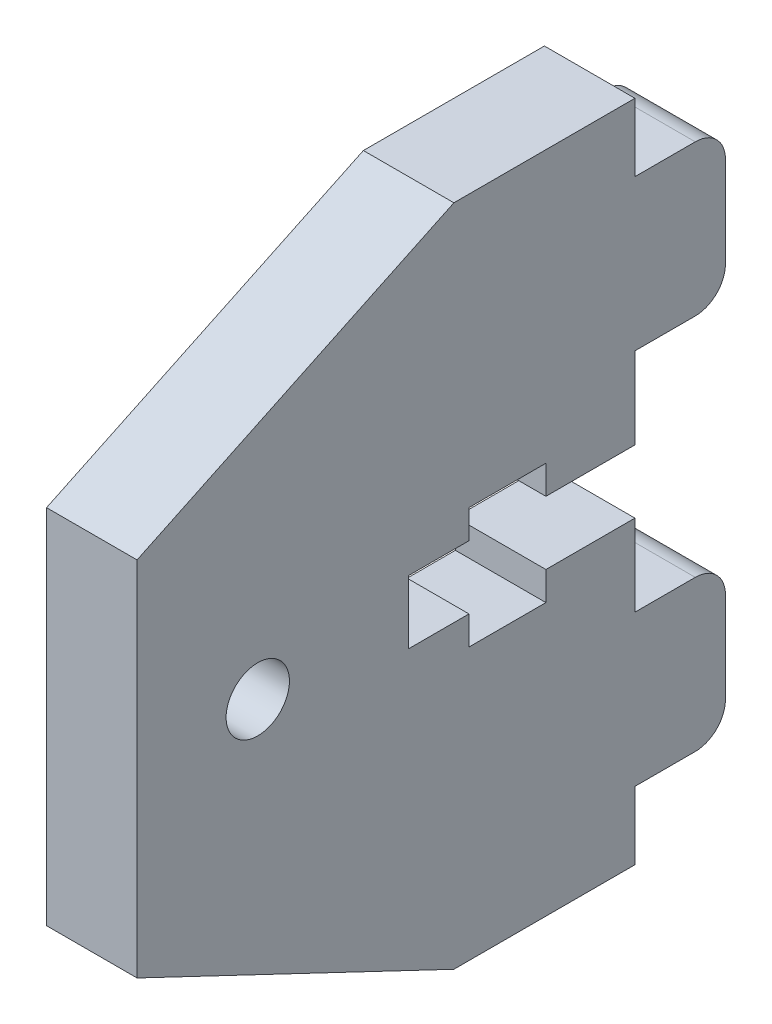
ISO-10303-21;
HEADER;
FILE_DESCRIPTION(('STEP AP214'),'2;1');
FILE_NAME('part.step','',(''),(''),'','','');
FILE_SCHEMA(('AUTOMOTIVE_DESIGN { 1 0 10303 214 1 1 1 1 }'));
ENDSEC;
DATA;
#1=APPLICATION_CONTEXT('core data for automotive mechanical design processes');
#2=APPLICATION_PROTOCOL_DEFINITION('international standard','automotive_design',2000,#1);
#3=PRODUCT_CONTEXT('',#1,'mechanical');
#4=PRODUCT('Part','Part','',(#3));
#5=PRODUCT_RELATED_PRODUCT_CATEGORY('part','',(#4));
#6=PRODUCT_DEFINITION_FORMATION('','',#4);
#7=PRODUCT_DEFINITION_CONTEXT('part definition',#1,'design');
#8=PRODUCT_DEFINITION('design','',#6,#7);
#9=PRODUCT_DEFINITION_SHAPE('','',#8);
#10=(LENGTH_UNIT() NAMED_UNIT(*) SI_UNIT(.MILLI.,.METRE.));
#11=(NAMED_UNIT(*) PLANE_ANGLE_UNIT() SI_UNIT($,.RADIAN.));
#12=(NAMED_UNIT(*) SI_UNIT($,.STERADIAN.) SOLID_ANGLE_UNIT());
#13=UNCERTAINTY_MEASURE_WITH_UNIT(LENGTH_MEASURE(1.E-05),#10,'distance_accuracy_value','');
#14=(GEOMETRIC_REPRESENTATION_CONTEXT(3) GLOBAL_UNCERTAINTY_ASSIGNED_CONTEXT((#13)) GLOBAL_UNIT_ASSIGNED_CONTEXT((#10,
#11,#12)) REPRESENTATION_CONTEXT('',''));
#15=CARTESIAN_POINT('',(0.,0.,0.));
#16=DIRECTION('',(0.,0.,1.));
#17=DIRECTION('',(1.,0.,0.));
#18=AXIS2_PLACEMENT_3D('',#15,#16,#17);
#19=CARTESIAN_POINT('',(6.,29.5,0.));
#20=DIRECTION('',(0.,1.,0.));
#21=DIRECTION('',(0.,0.,1.));
#22=AXIS2_PLACEMENT_3D('',#19,#20,#21);
#23=PLANE('',#22);
#24=DIRECTION('',(0.,0.,-1.));
#25=VECTOR('',#24,1.);
#26=CARTESIAN_POINT('',(0.,29.5,0.));
#27=LINE('',#26,#25);
#28=CARTESIAN_POINT('',(0.,29.5,0.));
#29=VERTEX_POINT('',#28);
#30=CARTESIAN_POINT('',(0.,29.5,-4.));
#31=VERTEX_POINT('',#30);
#32=EDGE_CURVE('E411',#29,#31,#27,.T.);
#33=ORIENTED_EDGE('',*,*,#32,.T.);
#34=DIRECTION('',(-1.,0.,0.));
#35=VECTOR('',#34,1.);
#36=CARTESIAN_POINT('',(6.,29.5,-4.));
#37=LINE('',#36,#35);
#38=CARTESIAN_POINT('',(6.,29.5,-4.));
#39=VERTEX_POINT('',#38);
#40=EDGE_CURVE('E11',#39,#31,#37,.T.);
#41=ORIENTED_EDGE('',*,*,#40,.F.);
#42=DIRECTION('',(0.,0.,-1.));
#43=VECTOR('',#42,1.);
#44=CARTESIAN_POINT('',(6.,29.5,0.));
#45=LINE('',#44,#43);
#46=CARTESIAN_POINT('',(6.,29.5,0.));
#47=VERTEX_POINT('',#46);
#48=EDGE_CURVE('E326',#47,#39,#45,.T.);
#49=ORIENTED_EDGE('',*,*,#48,.F.);
#50=DIRECTION('',(-1.,0.,0.));
#51=VECTOR('',#50,1.);
#52=CARTESIAN_POINT('',(6.,29.5,0.));
#53=LINE('',#52,#51);
#54=EDGE_CURVE('E342',#47,#29,#53,.T.);
#55=ORIENTED_EDGE('',*,*,#54,.T.);
#56=EDGE_LOOP('',(#33,#41,#49,#55));
#57=FACE_BOUND('',#56,.T.);
#58=ADVANCED_FACE('F37',(#57),#23,.F.);
#59=CARTESIAN_POINT('',(6.,31.5,-4.));
#60=DIRECTION('',(-1.,0.,0.));
#61=DIRECTION('',(0.,0.,1.));
#62=AXIS2_PLACEMENT_3D('',#59,#60,#61);
#63=CYLINDRICAL_SURFACE('',#62,2.);
#64=CARTESIAN_POINT('',(0.,31.5,-4.));
#65=DIRECTION('',(1.,0.,0.));
#66=DIRECTION('',(0.,0.,-1.));
#67=AXIS2_PLACEMENT_3D('',#64,#65,#66);
#68=CIRCLE('',#67,2.);
#69=CARTESIAN_POINT('',(0.,31.5,-6.));
#70=VERTEX_POINT('',#69);
#71=EDGE_CURVE('E406',#31,#70,#68,.T.);
#72=ORIENTED_EDGE('',*,*,#71,.T.);
#73=DIRECTION('',(-1.,0.,0.));
#74=VECTOR('',#73,1.);
#75=CARTESIAN_POINT('',(6.,31.5,-6.));
#76=LINE('',#75,#74);
#77=CARTESIAN_POINT('',(6.,31.5,-6.));
#78=VERTEX_POINT('',#77);
#79=EDGE_CURVE('E45',#78,#70,#76,.T.);
#80=ORIENTED_EDGE('',*,*,#79,.F.);
#81=CARTESIAN_POINT('',(6.,31.5,-4.));
#82=DIRECTION('',(1.,0.,0.));
#83=DIRECTION('',(0.,0.,-1.));
#84=AXIS2_PLACEMENT_3D('',#81,#82,#83);
#85=CIRCLE('',#84,2.);
#86=EDGE_CURVE('E158',#39,#78,#85,.T.);
#87=ORIENTED_EDGE('',*,*,#86,.F.);
#88=ORIENTED_EDGE('',*,*,#40,.T.);
#89=EDGE_LOOP('',(#72,#80,#87,#88));
#90=FACE_BOUND('',#89,.T.);
#91=ADVANCED_FACE('F407',(#90),#63,.T.);
#92=CARTESIAN_POINT('',(6.,0.,-6.00000000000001));
#93=DIRECTION('',(0.,0.,-1.));
#94=DIRECTION('',(0.,1.,0.));
#95=AXIS2_PLACEMENT_3D('',#92,#93,#94);
#96=PLANE('',#95);
#97=DIRECTION('',(0.,-1.,0.));
#98=VECTOR('',#97,1.);
#99=CARTESIAN_POINT('',(0.,0.,-6.00000000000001));
#100=LINE('',#99,#98);
#101=CARTESIAN_POINT('',(0.,37.5,-6.));
#102=VERTEX_POINT('',#101);
#103=EDGE_CURVE('E403',#102,#70,#100,.T.);
#104=ORIENTED_EDGE('',*,*,#103,.F.);
#105=DIRECTION('',(-1.,0.,0.));
#106=VECTOR('',#105,1.);
#107=CARTESIAN_POINT('',(6.,37.5,-6.));
#108=LINE('',#107,#106);
#109=CARTESIAN_POINT('',(6.,37.5,-6.));
#110=VERTEX_POINT('',#109);
#111=EDGE_CURVE('E397',#110,#102,#108,.T.);
#112=ORIENTED_EDGE('',*,*,#111,.F.);
#113=DIRECTION('',(0.,-1.,0.));
#114=VECTOR('',#113,1.);
#115=CARTESIAN_POINT('',(6.,0.,-6.00000000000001));
#116=LINE('',#115,#114);
#117=EDGE_CURVE('E322',#110,#78,#116,.T.);
#118=ORIENTED_EDGE('',*,*,#117,.T.);
#119=ORIENTED_EDGE('',*,*,#79,.T.);
#120=EDGE_LOOP('',(#104,#112,#118,#119));
#121=FACE_BOUND('',#120,.T.);
#122=ADVANCED_FACE('F401',(#121),#96,.T.);
#123=CARTESIAN_POINT('',(6.,37.5,-4.));
#124=DIRECTION('',(-1.,0.,0.));
#125=DIRECTION('',(0.,0.,1.));
#126=AXIS2_PLACEMENT_3D('',#123,#124,#125);
#127=CYLINDRICAL_SURFACE('',#126,2.);
#128=CARTESIAN_POINT('',(0.,37.5,-4.));
#129=DIRECTION('',(1.,0.,0.));
#130=DIRECTION('',(0.,0.,-1.));
#131=AXIS2_PLACEMENT_3D('',#128,#129,#130);
#132=CIRCLE('',#131,2.);
#133=CARTESIAN_POINT('',(0.,39.5,-4.));
#134=VERTEX_POINT('',#133);
#135=EDGE_CURVE('E416',#134,#102,#132,.F.);
#136=ORIENTED_EDGE('',*,*,#135,.F.);
#137=DIRECTION('',(-1.,0.,0.));
#138=VECTOR('',#137,1.);
#139=CARTESIAN_POINT('',(6.,39.5,-4.));
#140=LINE('',#139,#138);
#141=CARTESIAN_POINT('',(6.,39.5,-4.));
#142=VERTEX_POINT('',#141);
#143=EDGE_CURVE('E395',#142,#134,#140,.T.);
#144=ORIENTED_EDGE('',*,*,#143,.F.);
#145=CARTESIAN_POINT('',(6.,37.5,-4.));
#146=DIRECTION('',(1.,0.,0.));
#147=DIRECTION('',(0.,0.,-1.));
#148=AXIS2_PLACEMENT_3D('',#145,#146,#147);
#149=CIRCLE('',#148,2.);
#150=EDGE_CURVE('E319',#142,#110,#149,.F.);
#151=ORIENTED_EDGE('',*,*,#150,.T.);
#152=ORIENTED_EDGE('',*,*,#111,.T.);
#153=EDGE_LOOP('',(#136,#144,#151,#152));
#154=FACE_BOUND('',#153,.T.);
#155=ADVANCED_FACE('F613',(#154),#127,.T.);
#156=CARTESIAN_POINT('',(6.,39.5,0.));
#157=DIRECTION('',(0.,1.,0.));
#158=DIRECTION('',(0.,0.,1.));
#159=AXIS2_PLACEMENT_3D('',#156,#157,#158);
#160=PLANE('',#159);
#161=DIRECTION('',(0.,0.,-1.));
#162=VECTOR('',#161,1.);
#163=CARTESIAN_POINT('',(0.,39.5,0.));
#164=LINE('',#163,#162);
#165=CARTESIAN_POINT('',(0.,39.5,0.));
#166=VERTEX_POINT('',#165);
#167=EDGE_CURVE('E418',#166,#134,#164,.T.);
#168=ORIENTED_EDGE('',*,*,#167,.F.);
#169=DIRECTION('',(-1.,0.,0.));
#170=VECTOR('',#169,1.);
#171=CARTESIAN_POINT('',(6.,39.5,0.));
#172=LINE('',#171,#170);
#173=CARTESIAN_POINT('',(6.,39.5,0.));
#174=VERTEX_POINT('',#173);
#175=EDGE_CURVE('E393',#174,#166,#172,.T.);
#176=ORIENTED_EDGE('',*,*,#175,.F.);
#177=DIRECTION('',(0.,0.,-1.));
#178=VECTOR('',#177,1.);
#179=CARTESIAN_POINT('',(6.,39.5,0.));
#180=LINE('',#179,#178);
#181=EDGE_CURVE('E316',#174,#142,#180,.T.);
#182=ORIENTED_EDGE('',*,*,#181,.T.);
#183=ORIENTED_EDGE('',*,*,#143,.T.);
#184=EDGE_LOOP('',(#168,#176,#182,#183));
#185=FACE_BOUND('',#184,.T.);
#186=ADVANCED_FACE('F604',(#185),#160,.T.);
#187=CARTESIAN_POINT('',(6.,0.,0.));
#188=DIRECTION('',(0.,0.,1.));
#189=DIRECTION('',(0.,-1.,0.));
#190=AXIS2_PLACEMENT_3D('',#187,#188,#189);
#191=PLANE('',#190);
#192=DIRECTION('',(0.,1.,0.));
#193=VECTOR('',#192,1.);
#194=CARTESIAN_POINT('',(0.,0.,0.));
#195=LINE('',#194,#193);
#196=CARTESIAN_POINT('',(0.,44.,0.));
#197=VERTEX_POINT('',#196);
#198=EDGE_CURVE('E337',#166,#197,#195,.T.);
#199=ORIENTED_EDGE('',*,*,#198,.T.);
#200=DIRECTION('',(-1.,0.,0.));
#201=VECTOR('',#200,1.);
#202=CARTESIAN_POINT('',(6.,44.,0.));
#203=LINE('',#202,#201);
#204=CARTESIAN_POINT('',(6.,44.,0.));
#205=VERTEX_POINT('',#204);
#206=EDGE_CURVE('E390',#205,#197,#203,.T.);
#207=ORIENTED_EDGE('',*,*,#206,.F.);
#208=DIRECTION('',(0.,1.,0.));
#209=VECTOR('',#208,1.);
#210=CARTESIAN_POINT('',(6.,0.,0.));
#211=LINE('',#210,#209);
#212=EDGE_CURVE('E267',#174,#205,#211,.T.);
#213=ORIENTED_EDGE('',*,*,#212,.F.);
#214=ORIENTED_EDGE('',*,*,#175,.T.);
#215=EDGE_LOOP('',(#199,#207,#213,#214));
#216=FACE_BOUND('',#215,.T.);
#217=ADVANCED_FACE('F569',(#216),#191,.F.);
#218=CARTESIAN_POINT('',(6.,44.,0.));
#219=DIRECTION('',(0.,-1.,0.));
#220=DIRECTION('',(0.,0.,-1.));
#221=AXIS2_PLACEMENT_3D('',#218,#219,#220);
#222=PLANE('',#221);
#223=DIRECTION('',(0.,0.,1.));
#224=VECTOR('',#223,1.);
#225=CARTESIAN_POINT('',(0.,44.,0.));
#226=LINE('',#225,#224);
#227=CARTESIAN_POINT('',(0.,44.,12.));
#228=VERTEX_POINT('',#227);
#229=EDGE_CURVE('E423',#197,#228,#226,.T.);
#230=ORIENTED_EDGE('',*,*,#229,.T.);
#231=DIRECTION('',(-1.,0.,0.));
#232=VECTOR('',#231,1.);
#233=CARTESIAN_POINT('',(6.,44.,12.));
#234=LINE('',#233,#232);
#235=CARTESIAN_POINT('',(6.,44.,12.));
#236=VERTEX_POINT('',#235);
#237=EDGE_CURVE('E388',#236,#228,#234,.T.);
#238=ORIENTED_EDGE('',*,*,#237,.F.);
#239=DIRECTION('',(0.,0.,1.));
#240=VECTOR('',#239,1.);
#241=CARTESIAN_POINT('',(6.,44.,0.));
#242=LINE('',#241,#240);
#243=EDGE_CURVE('E314',#205,#236,#242,.T.);
#244=ORIENTED_EDGE('',*,*,#243,.F.);
#245=ORIENTED_EDGE('',*,*,#206,.T.);
#246=EDGE_LOOP('',(#230,#238,#244,#245));
#247=FACE_BOUND('',#246,.T.);
#248=ADVANCED_FACE('F603',(#247),#222,.F.);
#249=CARTESIAN_POINT('',(6.,40.5249537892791,19.2975970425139));
#250=DIRECTION('',(0.,0.90286051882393,0.429933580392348));
#251=DIRECTION('',(0.,-0.429933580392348,0.90286051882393));
#252=AXIS2_PLACEMENT_3D('',#249,#250,#251);
#253=PLANE('',#252);
#254=DIRECTION('',(0.,0.429933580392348,-0.90286051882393));
#255=VECTOR('',#254,1.);
#256=CARTESIAN_POINT('',(0.,40.5249537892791,19.2975970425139));
#257=LINE('',#256,#255);
#258=CARTESIAN_POINT('',(0.,34.,33.));
#259=VERTEX_POINT('',#258);
#260=EDGE_CURVE('E427',#259,#228,#257,.T.);
#261=ORIENTED_EDGE('',*,*,#260,.F.);
#262=DIRECTION('',(-1.,0.,0.));
#263=VECTOR('',#262,1.);
#264=CARTESIAN_POINT('',(6.,34.,33.));
#265=LINE('',#264,#263);
#266=CARTESIAN_POINT('',(6.,34.,33.));
#267=VERTEX_POINT('',#266);
#268=EDGE_CURVE('E386',#267,#259,#265,.T.);
#269=ORIENTED_EDGE('',*,*,#268,.F.);
#270=DIRECTION('',(0.,0.429933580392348,-0.90286051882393));
#271=VECTOR('',#270,1.);
#272=CARTESIAN_POINT('',(6.,40.5249537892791,19.2975970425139));
#273=LINE('',#272,#271);
#274=EDGE_CURVE('E311',#267,#236,#273,.T.);
#275=ORIENTED_EDGE('',*,*,#274,.T.);
#276=ORIENTED_EDGE('',*,*,#237,.T.);
#277=EDGE_LOOP('',(#261,#269,#275,#276));
#278=FACE_BOUND('',#277,.T.);
#279=ADVANCED_FACE('F610',(#278),#253,.T.);
#280=CARTESIAN_POINT('',(6.,0.,33.));
#281=DIRECTION('',(0.,0.,1.));
#282=DIRECTION('',(0.,-1.,0.));
#283=AXIS2_PLACEMENT_3D('',#280,#281,#282);
#284=PLANE('',#283);
#285=DIRECTION('',(0.,1.,0.));
#286=VECTOR('',#285,1.);
#287=CARTESIAN_POINT('',(0.,0.,33.));
#288=LINE('',#287,#286);
#289=CARTESIAN_POINT('',(0.,9.99999999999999,33.));
#290=VERTEX_POINT('',#289);
#291=EDGE_CURVE('E430',#290,#259,#288,.T.);
#292=ORIENTED_EDGE('',*,*,#291,.F.);
#293=DIRECTION('',(-1.,0.,0.));
#294=VECTOR('',#293,1.);
#295=CARTESIAN_POINT('',(6.,9.99999999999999,33.));
#296=LINE('',#295,#294);
#297=CARTESIAN_POINT('',(6.,9.99999999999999,33.));
#298=VERTEX_POINT('',#297);
#299=EDGE_CURVE('E384',#298,#290,#296,.T.);
#300=ORIENTED_EDGE('',*,*,#299,.F.);
#301=DIRECTION('',(0.,1.,0.));
#302=VECTOR('',#301,1.);
#303=CARTESIAN_POINT('',(6.,0.,33.));
#304=LINE('',#303,#302);
#305=EDGE_CURVE('E308',#298,#267,#304,.T.);
#306=ORIENTED_EDGE('',*,*,#305,.T.);
#307=ORIENTED_EDGE('',*,*,#268,.T.);
#308=EDGE_LOOP('',(#292,#300,#306,#307));
#309=FACE_BOUND('',#308,.T.);
#310=ADVANCED_FACE('F630',(#309),#284,.T.);
#311=CARTESIAN_POINT('',(6.,-4.65804066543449,2.21811460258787));
#312=DIRECTION('',(0.,0.902860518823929,-0.429933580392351));
#313=DIRECTION('',(0.,0.429933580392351,0.902860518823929));
#314=AXIS2_PLACEMENT_3D('',#311,#312,#313);
#315=PLANE('',#314);
#316=DIRECTION('',(0.,-0.429933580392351,-0.902860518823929));
#317=VECTOR('',#316,1.);
#318=CARTESIAN_POINT('',(0.,-4.65804066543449,2.21811460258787));
#319=LINE('',#318,#317);
#320=CARTESIAN_POINT('',(0.,0.,12.0000000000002));
#321=VERTEX_POINT('',#320);
#322=EDGE_CURVE('E433',#290,#321,#319,.T.);
#323=ORIENTED_EDGE('',*,*,#322,.T.);
#324=DIRECTION('',(-1.,0.,0.));
#325=VECTOR('',#324,1.);
#326=CARTESIAN_POINT('',(6.,0.,12.0000000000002));
#327=LINE('',#326,#325);
#328=CARTESIAN_POINT('',(6.,0.,12.0000000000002));
#329=VERTEX_POINT('',#328);
#330=EDGE_CURVE('E382',#329,#321,#327,.T.);
#331=ORIENTED_EDGE('',*,*,#330,.F.);
#332=DIRECTION('',(0.,-0.429933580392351,-0.902860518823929));
#333=VECTOR('',#332,1.);
#334=CARTESIAN_POINT('',(6.,-4.65804066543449,2.21811460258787));
#335=LINE('',#334,#333);
#336=EDGE_CURVE('E306',#298,#329,#335,.T.);
#337=ORIENTED_EDGE('',*,*,#336,.F.);
#338=ORIENTED_EDGE('',*,*,#299,.T.);
#339=EDGE_LOOP('',(#323,#331,#337,#338));
#340=FACE_BOUND('',#339,.T.);
#341=ADVANCED_FACE('F599',(#340),#315,.F.);
#342=CARTESIAN_POINT('',(6.,0.,0.));
#343=DIRECTION('',(0.,-1.,0.));
#344=DIRECTION('',(0.,0.,-1.));
#345=AXIS2_PLACEMENT_3D('',#342,#343,#344);
#346=PLANE('',#345);
#347=DIRECTION('',(0.,0.,1.));
#348=VECTOR('',#347,1.);
#349=CARTESIAN_POINT('',(0.,0.,0.));
#350=LINE('',#349,#348);
#351=CARTESIAN_POINT('',(0.,0.,0.));
#352=VERTEX_POINT('',#351);
#353=EDGE_CURVE('E436',#352,#321,#350,.T.);
#354=ORIENTED_EDGE('',*,*,#353,.F.);
#355=DIRECTION('',(-1.,0.,0.));
#356=VECTOR('',#355,1.);
#357=CARTESIAN_POINT('',(6.,0.,0.));
#358=LINE('',#357,#356);
#359=CARTESIAN_POINT('',(6.,0.,0.));
#360=VERTEX_POINT('',#359);
#361=EDGE_CURVE('E380',#360,#352,#358,.T.);
#362=ORIENTED_EDGE('',*,*,#361,.F.);
#363=DIRECTION('',(0.,0.,1.));
#364=VECTOR('',#363,1.);
#365=CARTESIAN_POINT('',(6.,0.,0.));
#366=LINE('',#365,#364);
#367=EDGE_CURVE('E303',#360,#329,#366,.T.);
#368=ORIENTED_EDGE('',*,*,#367,.T.);
#369=ORIENTED_EDGE('',*,*,#330,.T.);
#370=EDGE_LOOP('',(#354,#362,#368,#369));
#371=FACE_BOUND('',#370,.T.);
#372=ADVANCED_FACE('F593',(#371),#346,.T.);
#373=CARTESIAN_POINT('',(0.,4.5,0.));
#374=VERTEX_POINT('',#373);
#375=EDGE_CURVE('E424',#352,#374,#195,.T.);
#376=ORIENTED_EDGE('',*,*,#375,.T.);
#377=DIRECTION('',(-1.,0.,0.));
#378=VECTOR('',#377,1.);
#379=CARTESIAN_POINT('',(6.,4.5,0.));
#380=LINE('',#379,#378);
#381=CARTESIAN_POINT('',(6.,4.5,0.));
#382=VERTEX_POINT('',#381);
#383=EDGE_CURVE('E377',#382,#374,#380,.T.);
#384=ORIENTED_EDGE('',*,*,#383,.F.);
#385=EDGE_CURVE('E302',#360,#382,#211,.T.);
#386=ORIENTED_EDGE('',*,*,#385,.F.);
#387=ORIENTED_EDGE('',*,*,#361,.T.);
#388=EDGE_LOOP('',(#376,#384,#386,#387));
#389=FACE_BOUND('',#388,.T.);
#390=ADVANCED_FACE('F514',(#389),#191,.F.);
#391=CARTESIAN_POINT('',(6.,4.5,0.));
#392=DIRECTION('',(0.,1.,0.));
#393=DIRECTION('',(0.,0.,1.));
#394=AXIS2_PLACEMENT_3D('',#391,#392,#393);
#395=PLANE('',#394);
#396=DIRECTION('',(0.,0.,-1.));
#397=VECTOR('',#396,1.);
#398=CARTESIAN_POINT('',(0.,4.5,0.));
#399=LINE('',#398,#397);
#400=CARTESIAN_POINT('',(0.,4.5,-4.));
#401=VERTEX_POINT('',#400);
#402=EDGE_CURVE('E439',#374,#401,#399,.T.);
#403=ORIENTED_EDGE('',*,*,#402,.T.);
#404=DIRECTION('',(-1.,0.,0.));
#405=VECTOR('',#404,1.);
#406=CARTESIAN_POINT('',(6.,4.5,-4.));
#407=LINE('',#406,#405);
#408=CARTESIAN_POINT('',(6.,4.5,-4.));
#409=VERTEX_POINT('',#408);
#410=EDGE_CURVE('E374',#409,#401,#407,.T.);
#411=ORIENTED_EDGE('',*,*,#410,.F.);
#412=DIRECTION('',(0.,0.,-1.));
#413=VECTOR('',#412,1.);
#414=CARTESIAN_POINT('',(6.,4.5,0.));
#415=LINE('',#414,#413);
#416=EDGE_CURVE('E300',#382,#409,#415,.T.);
#417=ORIENTED_EDGE('',*,*,#416,.F.);
#418=ORIENTED_EDGE('',*,*,#383,.T.);
#419=EDGE_LOOP('',(#403,#411,#417,#418));
#420=FACE_BOUND('',#419,.T.);
#421=ADVANCED_FACE('F520',(#420),#395,.F.);
#422=CARTESIAN_POINT('',(6.,6.5,-4.));
#423=DIRECTION('',(-1.,0.,0.));
#424=DIRECTION('',(0.,0.,1.));
#425=AXIS2_PLACEMENT_3D('',#422,#423,#424);
#426=CYLINDRICAL_SURFACE('',#425,2.);
#427=CARTESIAN_POINT('',(0.,6.5,-4.));
#428=DIRECTION('',(1.,0.,0.));
#429=DIRECTION('',(0.,0.,-1.));
#430=AXIS2_PLACEMENT_3D('',#427,#428,#429);
#431=CIRCLE('',#430,2.);
#432=CARTESIAN_POINT('',(0.,6.5,-6.));
#433=VERTEX_POINT('',#432);
#434=EDGE_CURVE('E441',#401,#433,#431,.T.);
#435=ORIENTED_EDGE('',*,*,#434,.T.);
#436=DIRECTION('',(-1.,0.,0.));
#437=VECTOR('',#436,1.);
#438=CARTESIAN_POINT('',(6.,6.5,-6.));
#439=LINE('',#438,#437);
#440=CARTESIAN_POINT('',(6.,6.5,-6.));
#441=VERTEX_POINT('',#440);
#442=EDGE_CURVE('E372',#441,#433,#439,.T.);
#443=ORIENTED_EDGE('',*,*,#442,.F.);
#444=CARTESIAN_POINT('',(6.,6.5,-4.));
#445=DIRECTION('',(1.,0.,0.));
#446=DIRECTION('',(0.,0.,-1.));
#447=AXIS2_PLACEMENT_3D('',#444,#445,#446);
#448=CIRCLE('',#447,2.);
#449=EDGE_CURVE('E298',#409,#441,#448,.T.);
#450=ORIENTED_EDGE('',*,*,#449,.F.);
#451=ORIENTED_EDGE('',*,*,#410,.T.);
#452=EDGE_LOOP('',(#435,#443,#450,#451));
#453=FACE_BOUND('',#452,.T.);
#454=ADVANCED_FACE('F526',(#453),#426,.T.);
#455=CARTESIAN_POINT('',(6.,0.,-6.));
#456=DIRECTION('',(0.,0.,-1.));
#457=DIRECTION('',(0.,1.,0.));
#458=AXIS2_PLACEMENT_3D('',#455,#456,#457);
#459=PLANE('',#458);
#460=DIRECTION('',(0.,-1.,0.));
#461=VECTOR('',#460,1.);
#462=CARTESIAN_POINT('',(0.,0.,-6.));
#463=LINE('',#462,#461);
#464=CARTESIAN_POINT('',(0.,12.5,-6.));
#465=VERTEX_POINT('',#464);
#466=EDGE_CURVE('E444',#465,#433,#463,.T.);
#467=ORIENTED_EDGE('',*,*,#466,.F.);
#468=DIRECTION('',(-1.,0.,0.));
#469=VECTOR('',#468,1.);
#470=CARTESIAN_POINT('',(6.,12.5,-6.));
#471=LINE('',#470,#469);
#472=CARTESIAN_POINT('',(6.,12.5,-6.));
#473=VERTEX_POINT('',#472);
#474=EDGE_CURVE('E370',#473,#465,#471,.T.);
#475=ORIENTED_EDGE('',*,*,#474,.F.);
#476=DIRECTION('',(0.,-1.,0.));
#477=VECTOR('',#476,1.);
#478=CARTESIAN_POINT('',(6.,0.,-6.));
#479=LINE('',#478,#477);
#480=EDGE_CURVE('E295',#473,#441,#479,.T.);
#481=ORIENTED_EDGE('',*,*,#480,.T.);
#482=ORIENTED_EDGE('',*,*,#442,.T.);
#483=EDGE_LOOP('',(#467,#475,#481,#482));
#484=FACE_BOUND('',#483,.T.);
#485=ADVANCED_FACE('F537',(#484),#459,.T.);
#486=CARTESIAN_POINT('',(6.,12.5,-4.));
#487=DIRECTION('',(-1.,0.,0.));
#488=DIRECTION('',(0.,0.,1.));
#489=AXIS2_PLACEMENT_3D('',#486,#487,#488);
#490=CYLINDRICAL_SURFACE('',#489,2.);
#491=CARTESIAN_POINT('',(0.,12.5,-4.));
#492=DIRECTION('',(1.,0.,0.));
#493=DIRECTION('',(0.,0.,-1.));
#494=AXIS2_PLACEMENT_3D('',#491,#492,#493);
#495=CIRCLE('',#494,2.);
#496=CARTESIAN_POINT('',(0.,14.5,-4.));
#497=VERTEX_POINT('',#496);
#498=EDGE_CURVE('E447',#497,#465,#495,.F.);
#499=ORIENTED_EDGE('',*,*,#498,.F.);
#500=DIRECTION('',(-1.,0.,0.));
#501=VECTOR('',#500,1.);
#502=CARTESIAN_POINT('',(6.,14.5,-4.));
#503=LINE('',#502,#501);
#504=CARTESIAN_POINT('',(6.,14.5,-4.));
#505=VERTEX_POINT('',#504);
#506=EDGE_CURVE('E368',#505,#497,#503,.T.);
#507=ORIENTED_EDGE('',*,*,#506,.F.);
#508=CARTESIAN_POINT('',(6.,12.5,-4.));
#509=DIRECTION('',(1.,0.,0.));
#510=DIRECTION('',(0.,0.,-1.));
#511=AXIS2_PLACEMENT_3D('',#508,#509,#510);
#512=CIRCLE('',#511,2.);
#513=EDGE_CURVE('E292',#505,#473,#512,.F.);
#514=ORIENTED_EDGE('',*,*,#513,.T.);
#515=ORIENTED_EDGE('',*,*,#474,.T.);
#516=EDGE_LOOP('',(#499,#507,#514,#515));
#517=FACE_BOUND('',#516,.T.);
#518=ADVANCED_FACE('F535',(#517),#490,.T.);
#519=CARTESIAN_POINT('',(6.,14.5,0.));
#520=DIRECTION('',(0.,1.,0.));
#521=DIRECTION('',(0.,0.,1.));
#522=AXIS2_PLACEMENT_3D('',#519,#520,#521);
#523=PLANE('',#522);
#524=DIRECTION('',(0.,0.,-1.));
#525=VECTOR('',#524,1.);
#526=CARTESIAN_POINT('',(0.,14.5,0.));
#527=LINE('',#526,#525);
#528=CARTESIAN_POINT('',(0.,14.5,0.));
#529=VERTEX_POINT('',#528);
#530=EDGE_CURVE('E450',#529,#497,#527,.T.);
#531=ORIENTED_EDGE('',*,*,#530,.F.);
#532=DIRECTION('',(-1.,0.,0.));
#533=VECTOR('',#532,1.);
#534=CARTESIAN_POINT('',(6.,14.5,0.));
#535=LINE('',#534,#533);
#536=CARTESIAN_POINT('',(6.,14.5,0.));
#537=VERTEX_POINT('',#536);
#538=EDGE_CURVE('E366',#537,#529,#535,.T.);
#539=ORIENTED_EDGE('',*,*,#538,.F.);
#540=DIRECTION('',(0.,0.,-1.));
#541=VECTOR('',#540,1.);
#542=CARTESIAN_POINT('',(6.,14.5,0.));
#543=LINE('',#542,#541);
#544=EDGE_CURVE('E289',#537,#505,#543,.T.);
#545=ORIENTED_EDGE('',*,*,#544,.T.);
#546=ORIENTED_EDGE('',*,*,#506,.T.);
#547=EDGE_LOOP('',(#531,#539,#545,#546));
#548=FACE_BOUND('',#547,.T.);
#549=ADVANCED_FACE('F532',(#548),#523,.T.);
#550=CARTESIAN_POINT('',(0.,19.9,0.));
#551=VERTEX_POINT('',#550);
#552=EDGE_CURVE('E336',#529,#551,#195,.T.);
#553=ORIENTED_EDGE('',*,*,#552,.T.);
#554=DIRECTION('',(-1.,0.,0.));
#555=VECTOR('',#554,1.);
#556=CARTESIAN_POINT('',(6.,19.9,0.));
#557=LINE('',#556,#555);
#558=CARTESIAN_POINT('',(6.,19.9,0.));
#559=VERTEX_POINT('',#558);
#560=EDGE_CURVE('E363',#559,#551,#557,.T.);
#561=ORIENTED_EDGE('',*,*,#560,.F.);
#562=EDGE_CURVE('E266',#537,#559,#211,.T.);
#563=ORIENTED_EDGE('',*,*,#562,.F.);
#564=ORIENTED_EDGE('',*,*,#538,.T.);
#565=EDGE_LOOP('',(#553,#561,#563,#564));
#566=FACE_BOUND('',#565,.T.);
#567=ADVANCED_FACE('F508',(#566),#191,.F.);
#568=CARTESIAN_POINT('',(6.,19.9,0.));
#569=DIRECTION('',(0.,-1.,0.));
#570=DIRECTION('',(0.,0.,-1.));
#571=AXIS2_PLACEMENT_3D('',#568,#569,#570);
#572=PLANE('',#571);
#573=DIRECTION('',(0.,0.,1.));
#574=VECTOR('',#573,1.);
#575=CARTESIAN_POINT('',(0.,19.9,0.));
#576=LINE('',#575,#574);
#577=CARTESIAN_POINT('',(0.,19.9,5.9));
#578=VERTEX_POINT('',#577);
#579=EDGE_CURVE('E453',#551,#578,#576,.T.);
#580=ORIENTED_EDGE('',*,*,#579,.T.);
#581=DIRECTION('',(-1.,0.,0.));
#582=VECTOR('',#581,1.);
#583=CARTESIAN_POINT('',(6.,19.9,5.9));
#584=LINE('',#583,#582);
#585=CARTESIAN_POINT('',(6.,19.9,5.9));
#586=VERTEX_POINT('',#585);
#587=EDGE_CURVE('E360',#586,#578,#584,.T.);
#588=ORIENTED_EDGE('',*,*,#587,.F.);
#589=DIRECTION('',(0.,0.,1.));
#590=VECTOR('',#589,1.);
#591=CARTESIAN_POINT('',(6.,19.9,0.));
#592=LINE('',#591,#590);
#593=EDGE_CURVE('E283',#559,#586,#592,.T.);
#594=ORIENTED_EDGE('',*,*,#593,.F.);
#595=ORIENTED_EDGE('',*,*,#560,.T.);
#596=EDGE_LOOP('',(#580,#588,#594,#595));
#597=FACE_BOUND('',#596,.T.);
#598=ADVANCED_FACE('F504',(#597),#572,.F.);
#599=CARTESIAN_POINT('',(6.,0.,5.9));
#600=DIRECTION('',(0.,0.,-1.));
#601=DIRECTION('',(-1.,0.,0.));
#602=AXIS2_PLACEMENT_3D('',#599,#600,#601);
#603=PLANE('',#602);
#604=DIRECTION('',(0.,-1.,0.));
#605=VECTOR('',#604,1.);
#606=CARTESIAN_POINT('',(0.,0.,5.9));
#607=LINE('',#606,#605);
#608=CARTESIAN_POINT('',(0.,18.,5.9));
#609=VERTEX_POINT('',#608);
#610=EDGE_CURVE('E455',#578,#609,#607,.T.);
#611=ORIENTED_EDGE('',*,*,#610,.T.);
#612=DIRECTION('',(-1.,0.,0.));
#613=VECTOR('',#612,1.);
#614=CARTESIAN_POINT('',(6.,18.,5.9));
#615=LINE('',#614,#613);
#616=CARTESIAN_POINT('',(6.,18.,5.9));
#617=VERTEX_POINT('',#616);
#618=EDGE_CURVE('E358',#617,#609,#615,.T.);
#619=ORIENTED_EDGE('',*,*,#618,.F.);
#620=DIRECTION('',(0.,-1.,0.));
#621=VECTOR('',#620,1.);
#622=CARTESIAN_POINT('',(6.,0.,5.9));
#623=LINE('',#622,#621);
#624=EDGE_CURVE('E250',#586,#617,#623,.T.);
#625=ORIENTED_EDGE('',*,*,#624,.F.);
#626=ORIENTED_EDGE('',*,*,#587,.T.);
#627=EDGE_LOOP('',(#611,#619,#625,#626));
#628=FACE_BOUND('',#627,.T.);
#629=ADVANCED_FACE('F499',(#628),#603,.F.);
#630=CARTESIAN_POINT('',(6.,18.,0.));
#631=DIRECTION('',(0.,1.,0.));
#632=DIRECTION('',(0.,0.,1.));
#633=AXIS2_PLACEMENT_3D('',#630,#631,#632);
#634=PLANE('',#633);
#635=DIRECTION('',(0.,0.,-1.));
#636=VECTOR('',#635,1.);
#637=CARTESIAN_POINT('',(0.,18.,0.));
#638=LINE('',#637,#636);
#639=CARTESIAN_POINT('',(0.,18.,11.));
#640=VERTEX_POINT('',#639);
#641=EDGE_CURVE('E459',#640,#609,#638,.T.);
#642=ORIENTED_EDGE('',*,*,#641,.F.);
#643=DIRECTION('',(-1.,0.,0.));
#644=VECTOR('',#643,1.);
#645=CARTESIAN_POINT('',(6.,18.,11.));
#646=LINE('',#645,#644);
#647=CARTESIAN_POINT('',(6.,18.,11.));
#648=VERTEX_POINT('',#647);
#649=EDGE_CURVE('E356',#648,#640,#646,.T.);
#650=ORIENTED_EDGE('',*,*,#649,.F.);
#651=DIRECTION('',(0.,0.,-1.));
#652=VECTOR('',#651,1.);
#653=CARTESIAN_POINT('',(6.,18.,0.));
#654=LINE('',#653,#652);
#655=EDGE_CURVE('E286',#648,#617,#654,.T.);
#656=ORIENTED_EDGE('',*,*,#655,.T.);
#657=ORIENTED_EDGE('',*,*,#618,.T.);
#658=EDGE_LOOP('',(#642,#650,#656,#657));
#659=FACE_BOUND('',#658,.T.);
#660=ADVANCED_FACE('F493',(#659),#634,.T.);
#661=CARTESIAN_POINT('',(6.,0.,11.));
#662=DIRECTION('',(0.,0.,-1.));
#663=DIRECTION('',(-1.,0.,0.));
#664=AXIS2_PLACEMENT_3D('',#661,#662,#663);
#665=PLANE('',#664);
#666=DIRECTION('',(0.,-1.,0.));
#667=VECTOR('',#666,1.);
#668=CARTESIAN_POINT('',(0.,0.,11.));
#669=LINE('',#668,#667);
#670=CARTESIAN_POINT('',(0.,19.9,11.));
#671=VERTEX_POINT('',#670);
#672=EDGE_CURVE('E462',#671,#640,#669,.T.);
#673=ORIENTED_EDGE('',*,*,#672,.F.);
#674=DIRECTION('',(-1.,0.,0.));
#675=VECTOR('',#674,1.);
#676=CARTESIAN_POINT('',(6.,19.9,11.));
#677=LINE('',#676,#675);
#678=CARTESIAN_POINT('',(6.,19.9,11.));
#679=VERTEX_POINT('',#678);
#680=EDGE_CURVE('E354',#679,#671,#677,.T.);
#681=ORIENTED_EDGE('',*,*,#680,.F.);
#682=DIRECTION('',(0.,-1.,0.));
#683=VECTOR('',#682,1.);
#684=CARTESIAN_POINT('',(6.,0.,11.));
#685=LINE('',#684,#683);
#686=EDGE_CURVE('E277',#679,#648,#685,.T.);
#687=ORIENTED_EDGE('',*,*,#686,.T.);
#688=ORIENTED_EDGE('',*,*,#649,.T.);
#689=EDGE_LOOP('',(#673,#681,#687,#688));
#690=FACE_BOUND('',#689,.T.);
#691=ADVANCED_FACE('F487',(#690),#665,.T.);
#692=CARTESIAN_POINT('',(0.,19.9,15.));
#693=VERTEX_POINT('',#692);
#694=EDGE_CURVE('E456',#671,#693,#576,.T.);
#695=ORIENTED_EDGE('',*,*,#694,.T.);
#696=DIRECTION('',(-1.,0.,0.));
#697=VECTOR('',#696,1.);
#698=CARTESIAN_POINT('',(6.,19.9,15.));
#699=LINE('',#698,#697);
#700=CARTESIAN_POINT('',(6.,19.9,15.));
#701=VERTEX_POINT('',#700);
#702=EDGE_CURVE('E352',#701,#693,#699,.T.);
#703=ORIENTED_EDGE('',*,*,#702,.F.);
#704=EDGE_CURVE('E279',#679,#701,#592,.T.);
#705=ORIENTED_EDGE('',*,*,#704,.F.);
#706=ORIENTED_EDGE('',*,*,#680,.T.);
#707=EDGE_LOOP('',(#695,#703,#705,#706));
#708=FACE_BOUND('',#707,.T.);
#709=ADVANCED_FACE('F580',(#708),#572,.F.);
#710=CARTESIAN_POINT('',(6.,0.,15.));
#711=DIRECTION('',(0.,0.,-1.));
#712=DIRECTION('',(0.,1.,0.));
#713=AXIS2_PLACEMENT_3D('',#710,#711,#712);
#714=PLANE('',#713);
#715=DIRECTION('',(0.,-1.,0.));
#716=VECTOR('',#715,1.);
#717=CARTESIAN_POINT('',(0.,0.,15.));
#718=LINE('',#717,#716);
#719=CARTESIAN_POINT('',(0.,24.1,15.));
#720=VERTEX_POINT('',#719);
#721=EDGE_CURVE('E466',#720,#693,#718,.T.);
#722=ORIENTED_EDGE('',*,*,#721,.F.);
#723=DIRECTION('',(-1.,0.,0.));
#724=VECTOR('',#723,1.);
#725=CARTESIAN_POINT('',(6.,24.1,15.));
#726=LINE('',#725,#724);
#727=CARTESIAN_POINT('',(6.,24.1,15.));
#728=VERTEX_POINT('',#727);
#729=EDGE_CURVE('E350',#728,#720,#726,.T.);
#730=ORIENTED_EDGE('',*,*,#729,.F.);
#731=DIRECTION('',(0.,-1.,0.));
#732=VECTOR('',#731,1.);
#733=CARTESIAN_POINT('',(6.,0.,15.));
#734=LINE('',#733,#732);
#735=EDGE_CURVE('E272',#728,#701,#734,.T.);
#736=ORIENTED_EDGE('',*,*,#735,.T.);
#737=ORIENTED_EDGE('',*,*,#702,.T.);
#738=EDGE_LOOP('',(#722,#730,#736,#737));
#739=FACE_BOUND('',#738,.T.);
#740=ADVANCED_FACE('F480',(#739),#714,.T.);
#741=CARTESIAN_POINT('',(6.,24.1,0.));
#742=DIRECTION('',(0.,-1.,0.));
#743=DIRECTION('',(0.,0.,-1.));
#744=AXIS2_PLACEMENT_3D('',#741,#742,#743);
#745=PLANE('',#744);
#746=DIRECTION('',(0.,0.,1.));
#747=VECTOR('',#746,1.);
#748=CARTESIAN_POINT('',(0.,24.1,0.));
#749=LINE('',#748,#747);
#750=CARTESIAN_POINT('',(0.,24.1,11.));
#751=VERTEX_POINT('',#750);
#752=EDGE_CURVE('E468',#751,#720,#749,.T.);
#753=ORIENTED_EDGE('',*,*,#752,.F.);
#754=DIRECTION('',(-1.,0.,0.));
#755=VECTOR('',#754,1.);
#756=CARTESIAN_POINT('',(6.,24.1,11.));
#757=LINE('',#756,#755);
#758=CARTESIAN_POINT('',(6.,24.1,11.));
#759=VERTEX_POINT('',#758);
#760=EDGE_CURVE('E348',#759,#751,#757,.T.);
#761=ORIENTED_EDGE('',*,*,#760,.F.);
#762=DIRECTION('',(0.,0.,1.));
#763=VECTOR('',#762,1.);
#764=CARTESIAN_POINT('',(6.,24.1,0.));
#765=LINE('',#764,#763);
#766=EDGE_CURVE('E263',#759,#728,#765,.T.);
#767=ORIENTED_EDGE('',*,*,#766,.T.);
#768=ORIENTED_EDGE('',*,*,#729,.T.);
#769=EDGE_LOOP('',(#753,#761,#767,#768));
#770=FACE_BOUND('',#769,.T.);
#771=ADVANCED_FACE('F478',(#770),#745,.T.);
#772=CARTESIAN_POINT('',(0.,26.,11.));
#773=VERTEX_POINT('',#772);
#774=EDGE_CURVE('E465',#773,#751,#669,.T.);
#775=ORIENTED_EDGE('',*,*,#774,.F.);
#776=DIRECTION('',(-1.,0.,0.));
#777=VECTOR('',#776,1.);
#778=CARTESIAN_POINT('',(6.,26.,11.));
#779=LINE('',#778,#777);
#780=CARTESIAN_POINT('',(6.,26.,11.));
#781=VERTEX_POINT('',#780);
#782=EDGE_CURVE('E346',#781,#773,#779,.T.);
#783=ORIENTED_EDGE('',*,*,#782,.F.);
#784=EDGE_CURVE('E271',#781,#759,#685,.T.);
#785=ORIENTED_EDGE('',*,*,#784,.T.);
#786=ORIENTED_EDGE('',*,*,#760,.T.);
#787=EDGE_LOOP('',(#775,#783,#785,#786));
#788=FACE_BOUND('',#787,.T.);
#789=ADVANCED_FACE('F477',(#788),#665,.T.);
#790=CARTESIAN_POINT('',(6.,26.,0.));
#791=DIRECTION('',(0.,1.,0.));
#792=DIRECTION('',(0.,0.,1.));
#793=AXIS2_PLACEMENT_3D('',#790,#791,#792);
#794=PLANE('',#793);
#795=DIRECTION('',(0.,0.,-1.));
#796=VECTOR('',#795,1.);
#797=CARTESIAN_POINT('',(0.,26.,0.));
#798=LINE('',#797,#796);
#799=CARTESIAN_POINT('',(0.,26.,5.9));
#800=VERTEX_POINT('',#799);
#801=EDGE_CURVE('E340',#773,#800,#798,.T.);
#802=ORIENTED_EDGE('',*,*,#801,.T.);
#803=DIRECTION('',(-1.,0.,0.));
#804=VECTOR('',#803,1.);
#805=CARTESIAN_POINT('',(6.,26.,5.9));
#806=LINE('',#805,#804);
#807=CARTESIAN_POINT('',(6.,26.,5.9));
#808=VERTEX_POINT('',#807);
#809=EDGE_CURVE('E259',#808,#800,#806,.T.);
#810=ORIENTED_EDGE('',*,*,#809,.F.);
#811=DIRECTION('',(0.,0.,-1.));
#812=VECTOR('',#811,1.);
#813=CARTESIAN_POINT('',(6.,26.,0.));
#814=LINE('',#813,#812);
#815=EDGE_CURVE('E245',#781,#808,#814,.T.);
#816=ORIENTED_EDGE('',*,*,#815,.F.);
#817=ORIENTED_EDGE('',*,*,#782,.T.);
#818=EDGE_LOOP('',(#802,#810,#816,#817));
#819=FACE_BOUND('',#818,.T.);
#820=ADVANCED_FACE('F474',(#819),#794,.F.);
#821=CARTESIAN_POINT('',(0.,24.1,5.9));
#822=VERTEX_POINT('',#821);
#823=EDGE_CURVE('E255',#800,#822,#607,.T.);
#824=ORIENTED_EDGE('',*,*,#823,.T.);
#825=DIRECTION('',(-1.,0.,0.));
#826=VECTOR('',#825,1.);
#827=CARTESIAN_POINT('',(6.,24.1,5.9));
#828=LINE('',#827,#826);
#829=CARTESIAN_POINT('',(6.,24.1,5.9));
#830=VERTEX_POINT('',#829);
#831=EDGE_CURVE('E252',#830,#822,#828,.T.);
#832=ORIENTED_EDGE('',*,*,#831,.F.);
#833=EDGE_CURVE('E237',#808,#830,#623,.T.);
#834=ORIENTED_EDGE('',*,*,#833,.F.);
#835=ORIENTED_EDGE('',*,*,#809,.T.);
#836=EDGE_LOOP('',(#824,#832,#834,#835));
#837=FACE_BOUND('',#836,.T.);
#838=ADVANCED_FACE('F253',(#837),#603,.F.);
#839=CARTESIAN_POINT('',(0.,24.1,0.));
#840=VERTEX_POINT('',#839);
#841=EDGE_CURVE('E334',#840,#822,#749,.T.);
#842=ORIENTED_EDGE('',*,*,#841,.F.);
#843=DIRECTION('',(-1.,0.,0.));
#844=VECTOR('',#843,1.);
#845=CARTESIAN_POINT('',(6.,24.1,0.));
#846=LINE('',#845,#844);
#847=CARTESIAN_POINT('',(6.,24.1,0.));
#848=VERTEX_POINT('',#847);
#849=EDGE_CURVE('E147',#848,#840,#846,.T.);
#850=ORIENTED_EDGE('',*,*,#849,.F.);
#851=EDGE_CURVE('E242',#848,#830,#765,.T.);
#852=ORIENTED_EDGE('',*,*,#851,.T.);
#853=ORIENTED_EDGE('',*,*,#831,.T.);
#854=EDGE_LOOP('',(#842,#850,#852,#853));
#855=FACE_BOUND('',#854,.T.);
#856=ADVANCED_FACE('F261',(#855),#745,.T.);
#857=EDGE_CURVE('E150',#840,#29,#195,.T.);
#858=ORIENTED_EDGE('',*,*,#857,.T.);
#859=ORIENTED_EDGE('',*,*,#54,.F.);
#860=EDGE_CURVE('E53',#848,#47,#211,.T.);
#861=ORIENTED_EDGE('',*,*,#860,.F.);
#862=ORIENTED_EDGE('',*,*,#849,.T.);
#863=EDGE_LOOP('',(#858,#859,#861,#862));
#864=FACE_BOUND('',#863,.T.);
#865=ADVANCED_FACE('F564',(#864),#191,.F.);
#866=CARTESIAN_POINT('',(6.,22.,25.));
#867=DIRECTION('',(-1.,0.,0.));
#868=DIRECTION('',(0.,0.,1.));
#869=AXIS2_PLACEMENT_3D('',#866,#867,#868);
#870=CYLINDRICAL_SURFACE('',#869,2.1);
#871=CARTESIAN_POINT('',(6.,22.,25.));
#872=DIRECTION('',(1.,0.,0.));
#873=DIRECTION('',(0.,0.,-1.));
#874=AXIS2_PLACEMENT_3D('',#871,#872,#873);
#875=CIRCLE('',#874,2.1);
#876=CARTESIAN_POINT('',(6.,22.,22.9));
#877=VERTEX_POINT('',#876);
#878=EDGE_CURVE('E264',#877,#877,#875,.T.);
#879=ORIENTED_EDGE('',*,*,#878,.T.);
#880=EDGE_LOOP('',(#879));
#881=FACE_BOUND('',#880,.T.);
#882=CARTESIAN_POINT('',(0.,22.,25.));
#883=DIRECTION('',(1.,0.,0.));
#884=DIRECTION('',(0.,0.,-1.));
#885=AXIS2_PLACEMENT_3D('',#882,#883,#884);
#886=CIRCLE('',#885,2.1);
#887=CARTESIAN_POINT('',(0.,22.,22.9));
#888=VERTEX_POINT('',#887);
#889=EDGE_CURVE('E327',#888,#888,#886,.T.);
#890=ORIENTED_EDGE('',*,*,#889,.F.);
#891=EDGE_LOOP('',(#890));
#892=FACE_BOUND('',#891,.T.);
#893=ADVANCED_FACE('F555',(#881,#892),#870,.F.);
#894=CARTESIAN_POINT('',(6.,0.,0.));
#895=DIRECTION('',(1.,0.,0.));
#896=DIRECTION('',(0.,0.,-1.));
#897=AXIS2_PLACEMENT_3D('',#894,#895,#896);
#898=PLANE('',#897);
#899=ORIENTED_EDGE('',*,*,#48,.T.);
#900=ORIENTED_EDGE('',*,*,#86,.T.);
#901=ORIENTED_EDGE('',*,*,#117,.F.);
#902=ORIENTED_EDGE('',*,*,#150,.F.);
#903=ORIENTED_EDGE('',*,*,#181,.F.);
#904=ORIENTED_EDGE('',*,*,#212,.T.);
#905=ORIENTED_EDGE('',*,*,#243,.T.);
#906=ORIENTED_EDGE('',*,*,#274,.F.);
#907=ORIENTED_EDGE('',*,*,#305,.F.);
#908=ORIENTED_EDGE('',*,*,#336,.T.);
#909=ORIENTED_EDGE('',*,*,#367,.F.);
#910=ORIENTED_EDGE('',*,*,#385,.T.);
#911=ORIENTED_EDGE('',*,*,#416,.T.);
#912=ORIENTED_EDGE('',*,*,#449,.T.);
#913=ORIENTED_EDGE('',*,*,#480,.F.);
#914=ORIENTED_EDGE('',*,*,#513,.F.);
#915=ORIENTED_EDGE('',*,*,#544,.F.);
#916=ORIENTED_EDGE('',*,*,#562,.T.);
#917=ORIENTED_EDGE('',*,*,#593,.T.);
#918=ORIENTED_EDGE('',*,*,#624,.T.);
#919=ORIENTED_EDGE('',*,*,#655,.F.);
#920=ORIENTED_EDGE('',*,*,#686,.F.);
#921=ORIENTED_EDGE('',*,*,#704,.T.);
#922=ORIENTED_EDGE('',*,*,#735,.F.);
#923=ORIENTED_EDGE('',*,*,#766,.F.);
#924=ORIENTED_EDGE('',*,*,#784,.F.);
#925=ORIENTED_EDGE('',*,*,#815,.T.);
#926=ORIENTED_EDGE('',*,*,#833,.T.);
#927=ORIENTED_EDGE('',*,*,#851,.F.);
#928=ORIENTED_EDGE('',*,*,#860,.T.);
#929=EDGE_LOOP('',(#899,#900,#901,#902,#903,#904,#905,#906,#907,#908,#909,#910,#911,#912,#913,
#914,#915,#916,#917,#918,#919,#920,#921,#922,#923,#924,#925,#926,#927,#928));
#930=FACE_BOUND('',#929,.T.);
#931=ORIENTED_EDGE('',*,*,#878,.F.);
#932=EDGE_LOOP('',(#931));
#933=FACE_BOUND('',#932,.T.);
#934=ADVANCED_FACE('F239',(#930,#933),#898,.T.);
#935=CARTESIAN_POINT('',(0.,0.,0.));
#936=DIRECTION('',(1.,0.,0.));
#937=DIRECTION('',(0.,0.,-1.));
#938=AXIS2_PLACEMENT_3D('',#935,#936,#937);
#939=PLANE('',#938);
#940=ORIENTED_EDGE('',*,*,#32,.F.);
#941=ORIENTED_EDGE('',*,*,#857,.F.);
#942=ORIENTED_EDGE('',*,*,#841,.T.);
#943=ORIENTED_EDGE('',*,*,#823,.F.);
#944=ORIENTED_EDGE('',*,*,#801,.F.);
#945=ORIENTED_EDGE('',*,*,#774,.T.);
#946=ORIENTED_EDGE('',*,*,#752,.T.);
#947=ORIENTED_EDGE('',*,*,#721,.T.);
#948=ORIENTED_EDGE('',*,*,#694,.F.);
#949=ORIENTED_EDGE('',*,*,#672,.T.);
#950=ORIENTED_EDGE('',*,*,#641,.T.);
#951=ORIENTED_EDGE('',*,*,#610,.F.);
#952=ORIENTED_EDGE('',*,*,#579,.F.);
#953=ORIENTED_EDGE('',*,*,#552,.F.);
#954=ORIENTED_EDGE('',*,*,#530,.T.);
#955=ORIENTED_EDGE('',*,*,#498,.T.);
#956=ORIENTED_EDGE('',*,*,#466,.T.);
#957=ORIENTED_EDGE('',*,*,#434,.F.);
#958=ORIENTED_EDGE('',*,*,#402,.F.);
#959=ORIENTED_EDGE('',*,*,#375,.F.);
#960=ORIENTED_EDGE('',*,*,#353,.T.);
#961=ORIENTED_EDGE('',*,*,#322,.F.);
#962=ORIENTED_EDGE('',*,*,#291,.T.);
#963=ORIENTED_EDGE('',*,*,#260,.T.);
#964=ORIENTED_EDGE('',*,*,#229,.F.);
#965=ORIENTED_EDGE('',*,*,#198,.F.);
#966=ORIENTED_EDGE('',*,*,#167,.T.);
#967=ORIENTED_EDGE('',*,*,#135,.T.);
#968=ORIENTED_EDGE('',*,*,#103,.T.);
#969=ORIENTED_EDGE('',*,*,#71,.F.);
#970=EDGE_LOOP('',(#940,#941,#942,#943,#944,#945,#946,#947,#948,#949,#950,#951,#952,#953,#954,
#955,#956,#957,#958,#959,#960,#961,#962,#963,#964,#965,#966,#967,#968,#969));
#971=FACE_BOUND('',#970,.T.);
#972=ORIENTED_EDGE('',*,*,#889,.T.);
#973=EDGE_LOOP('',(#972));
#974=FACE_BOUND('',#973,.T.);
#975=ADVANCED_FACE('F413',(#971,#974),#939,.F.);
#976=CLOSED_SHELL('',(#58,#91,#122,#155,#186,#217,#248,#279,#310,#341,#372,#390,#421,#454,#485,
#518,#549,#567,#598,#629,#660,#691,#709,#740,#771,#789,#820,#838,#856,#865,#893,#934,#975));
#977=MANIFOLD_SOLID_BREP('B2',#976);
#978=ADVANCED_BREP_SHAPE_REPRESENTATION('',(#18,#977),#14);
#979=SHAPE_DEFINITION_REPRESENTATION(#9,#978);
ENDSEC;
END-ISO-10303-21;
